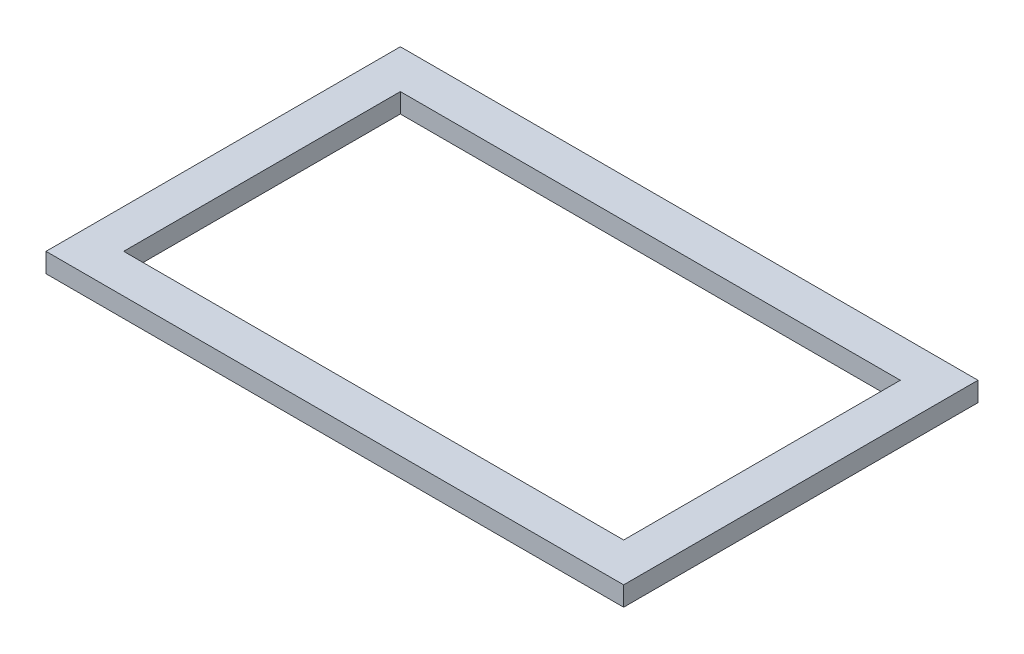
ISO-10303-21;
HEADER;
FILE_DESCRIPTION(('STEP AP214'),'2;1');
FILE_NAME('part.step','',(''),(''),'','','');
FILE_SCHEMA(('AUTOMOTIVE_DESIGN { 1 0 10303 214 1 1 1 1 }'));
ENDSEC;
DATA;
#1=APPLICATION_CONTEXT('core data for automotive mechanical design processes');
#2=APPLICATION_PROTOCOL_DEFINITION('international standard','automotive_design',2000,#1);
#3=PRODUCT_CONTEXT('',#1,'mechanical');
#4=PRODUCT('Part','Part','',(#3));
#5=PRODUCT_RELATED_PRODUCT_CATEGORY('part','',(#4));
#6=PRODUCT_DEFINITION_FORMATION('','',#4);
#7=PRODUCT_DEFINITION_CONTEXT('part definition',#1,'design');
#8=PRODUCT_DEFINITION('design','',#6,#7);
#9=PRODUCT_DEFINITION_SHAPE('','',#8);
#10=(LENGTH_UNIT() NAMED_UNIT(*) SI_UNIT(.MILLI.,.METRE.));
#11=(NAMED_UNIT(*) PLANE_ANGLE_UNIT() SI_UNIT($,.RADIAN.));
#12=(NAMED_UNIT(*) SI_UNIT($,.STERADIAN.) SOLID_ANGLE_UNIT());
#13=UNCERTAINTY_MEASURE_WITH_UNIT(LENGTH_MEASURE(1.E-05),#10,'distance_accuracy_value','');
#14=(GEOMETRIC_REPRESENTATION_CONTEXT(3) GLOBAL_UNCERTAINTY_ASSIGNED_CONTEXT((#13)) GLOBAL_UNIT_ASSIGNED_CONTEXT((#10,
#11,#12)) REPRESENTATION_CONTEXT('',''));
#15=CARTESIAN_POINT('',(0.,0.,0.));
#16=DIRECTION('',(0.,0.,1.));
#17=DIRECTION('',(1.,0.,0.));
#18=AXIS2_PLACEMENT_3D('',#15,#16,#17);
#19=CARTESIAN_POINT('',(59.5,4.,-36.5));
#20=DIRECTION('',(0.,-1.,0.));
#21=DIRECTION('',(0.,0.,-1.));
#22=AXIS2_PLACEMENT_3D('',#19,#20,#21);
#23=PLANE('',#22);
#24=DIRECTION('',(0.,0.,-1.));
#25=VECTOR('',#24,1.);
#26=CARTESIAN_POINT('',(59.5,4.,36.5));
#27=LINE('',#26,#25);
#28=CARTESIAN_POINT('',(59.5,4.,36.5));
#29=VERTEX_POINT('',#28);
#30=CARTESIAN_POINT('',(59.5,4.,-36.5));
#31=VERTEX_POINT('',#30);
#32=EDGE_CURVE('E132',#29,#31,#27,.T.);
#33=ORIENTED_EDGE('',*,*,#32,.T.);
#34=DIRECTION('',(-1.,0.,0.));
#35=VECTOR('',#34,1.);
#36=CARTESIAN_POINT('',(-59.5,4.,-36.5));
#37=LINE('',#36,#35);
#38=CARTESIAN_POINT('',(-59.5,4.,-36.5));
#39=VERTEX_POINT('',#38);
#40=EDGE_CURVE('E135',#31,#39,#37,.T.);
#41=ORIENTED_EDGE('',*,*,#40,.T.);
#42=DIRECTION('',(0.,0.,1.));
#43=VECTOR('',#42,1.);
#44=CARTESIAN_POINT('',(-59.5,4.,36.5));
#45=LINE('',#44,#43);
#46=CARTESIAN_POINT('',(-59.5,4.,36.5));
#47=VERTEX_POINT('',#46);
#48=EDGE_CURVE('E138',#39,#47,#45,.T.);
#49=ORIENTED_EDGE('',*,*,#48,.T.);
#50=DIRECTION('',(1.,0.,0.));
#51=VECTOR('',#50,1.);
#52=CARTESIAN_POINT('',(-59.5,4.,36.5));
#53=LINE('',#52,#51);
#54=EDGE_CURVE('E140',#47,#29,#53,.T.);
#55=ORIENTED_EDGE('',*,*,#54,.T.);
#56=EDGE_LOOP('',(#33,#41,#49,#55));
#57=FACE_BOUND('',#56,.T.);
#58=DIRECTION('',(0.,0.,-1.));
#59=VECTOR('',#58,1.);
#60=CARTESIAN_POINT('',(51.5,4.,28.5));
#61=LINE('',#60,#59);
#62=CARTESIAN_POINT('',(51.5,4.,28.5));
#63=VERTEX_POINT('',#62);
#64=CARTESIAN_POINT('',(51.5,4.,-28.5));
#65=VERTEX_POINT('',#64);
#66=EDGE_CURVE('E96',#63,#65,#61,.T.);
#67=ORIENTED_EDGE('',*,*,#66,.F.);
#68=DIRECTION('',(1.,0.,0.));
#69=VECTOR('',#68,1.);
#70=CARTESIAN_POINT('',(-51.5,4.,28.5));
#71=LINE('',#70,#69);
#72=CARTESIAN_POINT('',(-51.5,4.,28.5));
#73=VERTEX_POINT('',#72);
#74=EDGE_CURVE('E118',#73,#63,#71,.T.);
#75=ORIENTED_EDGE('',*,*,#74,.F.);
#76=DIRECTION('',(0.,0.,1.));
#77=VECTOR('',#76,1.);
#78=CARTESIAN_POINT('',(-51.5,4.,28.5));
#79=LINE('',#78,#77);
#80=CARTESIAN_POINT('',(-51.5,4.,-28.5));
#81=VERTEX_POINT('',#80);
#82=EDGE_CURVE('E116',#81,#73,#79,.T.);
#83=ORIENTED_EDGE('',*,*,#82,.F.);
#84=DIRECTION('',(-1.,0.,0.));
#85=VECTOR('',#84,1.);
#86=CARTESIAN_POINT('',(-51.5,4.,-28.5));
#87=LINE('',#86,#85);
#88=EDGE_CURVE('E104',#65,#81,#87,.T.);
#89=ORIENTED_EDGE('',*,*,#88,.F.);
#90=EDGE_LOOP('',(#67,#75,#83,#89));
#91=FACE_BOUND('',#90,.T.);
#92=ADVANCED_FACE('F31',(#57,#91),#23,.F.);
#93=CARTESIAN_POINT('',(59.5,0.,-36.5));
#94=DIRECTION('',(0.,-1.,0.));
#95=DIRECTION('',(0.,0.,-1.));
#96=AXIS2_PLACEMENT_3D('',#93,#94,#95);
#97=PLANE('',#96);
#98=DIRECTION('',(0.,0.,-1.));
#99=VECTOR('',#98,1.);
#100=CARTESIAN_POINT('',(59.5,0.,36.5));
#101=LINE('',#100,#99);
#102=CARTESIAN_POINT('',(59.5,0.,36.5));
#103=VERTEX_POINT('',#102);
#104=CARTESIAN_POINT('',(59.5,0.,-36.5));
#105=VERTEX_POINT('',#104);
#106=EDGE_CURVE('E112',#103,#105,#101,.T.);
#107=ORIENTED_EDGE('',*,*,#106,.F.);
#108=DIRECTION('',(1.,0.,0.));
#109=VECTOR('',#108,1.);
#110=CARTESIAN_POINT('',(-59.5,0.,36.5));
#111=LINE('',#110,#109);
#112=CARTESIAN_POINT('',(-59.5,0.,36.5));
#113=VERTEX_POINT('',#112);
#114=EDGE_CURVE('E136',#113,#103,#111,.T.);
#115=ORIENTED_EDGE('',*,*,#114,.F.);
#116=DIRECTION('',(0.,0.,1.));
#117=VECTOR('',#116,1.);
#118=CARTESIAN_POINT('',(-59.5,0.,36.5));
#119=LINE('',#118,#117);
#120=CARTESIAN_POINT('',(-59.5,0.,-36.5));
#121=VERTEX_POINT('',#120);
#122=EDGE_CURVE('E147',#121,#113,#119,.T.);
#123=ORIENTED_EDGE('',*,*,#122,.F.);
#124=DIRECTION('',(-1.,0.,0.));
#125=VECTOR('',#124,1.);
#126=CARTESIAN_POINT('',(-59.5,0.,-36.5));
#127=LINE('',#126,#125);
#128=EDGE_CURVE('E145',#105,#121,#127,.T.);
#129=ORIENTED_EDGE('',*,*,#128,.F.);
#130=EDGE_LOOP('',(#107,#115,#123,#129));
#131=FACE_BOUND('',#130,.T.);
#132=DIRECTION('',(1.,0.,0.));
#133=VECTOR('',#132,1.);
#134=CARTESIAN_POINT('',(-51.5,0.,28.5));
#135=LINE('',#134,#133);
#136=CARTESIAN_POINT('',(-51.5,0.,28.5));
#137=VERTEX_POINT('',#136);
#138=CARTESIAN_POINT('',(51.5,0.,28.5));
#139=VERTEX_POINT('',#138);
#140=EDGE_CURVE('E105',#137,#139,#135,.T.);
#141=ORIENTED_EDGE('',*,*,#140,.T.);
#142=DIRECTION('',(0.,0.,-1.));
#143=VECTOR('',#142,1.);
#144=CARTESIAN_POINT('',(51.5,0.,28.5));
#145=LINE('',#144,#143);
#146=CARTESIAN_POINT('',(51.5,0.,-28.5));
#147=VERTEX_POINT('',#146);
#148=EDGE_CURVE('E54',#139,#147,#145,.T.);
#149=ORIENTED_EDGE('',*,*,#148,.T.);
#150=DIRECTION('',(-1.,0.,0.));
#151=VECTOR('',#150,1.);
#152=CARTESIAN_POINT('',(-51.5,0.,-28.5));
#153=LINE('',#152,#151);
#154=CARTESIAN_POINT('',(-51.5,0.,-28.5));
#155=VERTEX_POINT('',#154);
#156=EDGE_CURVE('E111',#147,#155,#153,.T.);
#157=ORIENTED_EDGE('',*,*,#156,.T.);
#158=DIRECTION('',(0.,0.,1.));
#159=VECTOR('',#158,1.);
#160=CARTESIAN_POINT('',(-51.5,0.,28.5));
#161=LINE('',#160,#159);
#162=EDGE_CURVE('E124',#155,#137,#161,.T.);
#163=ORIENTED_EDGE('',*,*,#162,.T.);
#164=EDGE_LOOP('',(#141,#149,#157,#163));
#165=FACE_BOUND('',#164,.T.);
#166=ADVANCED_FACE('F165',(#131,#165),#97,.T.);
#167=CARTESIAN_POINT('',(59.5,4.,36.5));
#168=DIRECTION('',(-1.,0.,0.));
#169=DIRECTION('',(0.,0.,1.));
#170=AXIS2_PLACEMENT_3D('',#167,#168,#169);
#171=PLANE('',#170);
#172=ORIENTED_EDGE('',*,*,#106,.T.);
#173=DIRECTION('',(0.,-1.,0.));
#174=VECTOR('',#173,1.);
#175=CARTESIAN_POINT('',(59.5,4.,-36.5));
#176=LINE('',#175,#174);
#177=EDGE_CURVE('E11',#31,#105,#176,.T.);
#178=ORIENTED_EDGE('',*,*,#177,.F.);
#179=ORIENTED_EDGE('',*,*,#32,.F.);
#180=DIRECTION('',(0.,-1.,0.));
#181=VECTOR('',#180,1.);
#182=CARTESIAN_POINT('',(59.5,4.,36.5));
#183=LINE('',#182,#181);
#184=EDGE_CURVE('E142',#29,#103,#183,.T.);
#185=ORIENTED_EDGE('',*,*,#184,.T.);
#186=EDGE_LOOP('',(#172,#178,#179,#185));
#187=FACE_BOUND('',#186,.T.);
#188=ADVANCED_FACE('F33',(#187),#171,.F.);
#189=CARTESIAN_POINT('',(-59.5,4.,-36.5));
#190=DIRECTION('',(0.,0.,1.));
#191=DIRECTION('',(1.,0.,0.));
#192=AXIS2_PLACEMENT_3D('',#189,#190,#191);
#193=PLANE('',#192);
#194=ORIENTED_EDGE('',*,*,#128,.T.);
#195=DIRECTION('',(0.,-1.,0.));
#196=VECTOR('',#195,1.);
#197=CARTESIAN_POINT('',(-59.5,4.,-36.5));
#198=LINE('',#197,#196);
#199=EDGE_CURVE('E39',#39,#121,#198,.T.);
#200=ORIENTED_EDGE('',*,*,#199,.F.);
#201=ORIENTED_EDGE('',*,*,#40,.F.);
#202=ORIENTED_EDGE('',*,*,#177,.T.);
#203=EDGE_LOOP('',(#194,#200,#201,#202));
#204=FACE_BOUND('',#203,.T.);
#205=ADVANCED_FACE('F175',(#204),#193,.F.);
#206=CARTESIAN_POINT('',(-59.5,4.,36.5));
#207=DIRECTION('',(1.,0.,0.));
#208=DIRECTION('',(0.,0.,-1.));
#209=AXIS2_PLACEMENT_3D('',#206,#207,#208);
#210=PLANE('',#209);
#211=ORIENTED_EDGE('',*,*,#122,.T.);
#212=DIRECTION('',(0.,-1.,0.));
#213=VECTOR('',#212,1.);
#214=CARTESIAN_POINT('',(-59.5,4.,36.5));
#215=LINE('',#214,#213);
#216=EDGE_CURVE('E152',#47,#113,#215,.T.);
#217=ORIENTED_EDGE('',*,*,#216,.F.);
#218=ORIENTED_EDGE('',*,*,#48,.F.);
#219=ORIENTED_EDGE('',*,*,#199,.T.);
#220=EDGE_LOOP('',(#211,#217,#218,#219));
#221=FACE_BOUND('',#220,.T.);
#222=ADVANCED_FACE('F159',(#221),#210,.F.);
#223=CARTESIAN_POINT('',(-59.5,4.,36.5));
#224=DIRECTION('',(0.,0.,-1.));
#225=DIRECTION('',(-1.,0.,0.));
#226=AXIS2_PLACEMENT_3D('',#223,#224,#225);
#227=PLANE('',#226);
#228=ORIENTED_EDGE('',*,*,#114,.T.);
#229=ORIENTED_EDGE('',*,*,#184,.F.);
#230=ORIENTED_EDGE('',*,*,#54,.F.);
#231=ORIENTED_EDGE('',*,*,#216,.T.);
#232=EDGE_LOOP('',(#228,#229,#230,#231));
#233=FACE_BOUND('',#232,.T.);
#234=ADVANCED_FACE('F169',(#233),#227,.F.);
#235=CARTESIAN_POINT('',(51.5,4.,28.5));
#236=DIRECTION('',(-1.,0.,0.));
#237=DIRECTION('',(0.,0.,1.));
#238=AXIS2_PLACEMENT_3D('',#235,#236,#237);
#239=PLANE('',#238);
#240=ORIENTED_EDGE('',*,*,#148,.F.);
#241=DIRECTION('',(0.,-1.,0.));
#242=VECTOR('',#241,1.);
#243=CARTESIAN_POINT('',(51.5,4.,28.5));
#244=LINE('',#243,#242);
#245=EDGE_CURVE('E100',#63,#139,#244,.T.);
#246=ORIENTED_EDGE('',*,*,#245,.F.);
#247=ORIENTED_EDGE('',*,*,#66,.T.);
#248=DIRECTION('',(0.,-1.,0.));
#249=VECTOR('',#248,1.);
#250=CARTESIAN_POINT('',(51.5,4.,-28.5));
#251=LINE('',#250,#249);
#252=EDGE_CURVE('E99',#65,#147,#251,.T.);
#253=ORIENTED_EDGE('',*,*,#252,.T.);
#254=EDGE_LOOP('',(#240,#246,#247,#253));
#255=FACE_BOUND('',#254,.T.);
#256=ADVANCED_FACE('F98',(#255),#239,.T.);
#257=CARTESIAN_POINT('',(-51.5,4.,-28.5));
#258=DIRECTION('',(0.,0.,1.));
#259=DIRECTION('',(1.,0.,0.));
#260=AXIS2_PLACEMENT_3D('',#257,#258,#259);
#261=PLANE('',#260);
#262=ORIENTED_EDGE('',*,*,#156,.F.);
#263=ORIENTED_EDGE('',*,*,#252,.F.);
#264=ORIENTED_EDGE('',*,*,#88,.T.);
#265=DIRECTION('',(0.,-1.,0.));
#266=VECTOR('',#265,1.);
#267=CARTESIAN_POINT('',(-51.5,4.,-28.5));
#268=LINE('',#267,#266);
#269=EDGE_CURVE('E113',#81,#155,#268,.T.);
#270=ORIENTED_EDGE('',*,*,#269,.T.);
#271=EDGE_LOOP('',(#262,#263,#264,#270));
#272=FACE_BOUND('',#271,.T.);
#273=ADVANCED_FACE('F108',(#272),#261,.T.);
#274=CARTESIAN_POINT('',(-51.5,4.,28.5));
#275=DIRECTION('',(1.,0.,0.));
#276=DIRECTION('',(0.,0.,-1.));
#277=AXIS2_PLACEMENT_3D('',#274,#275,#276);
#278=PLANE('',#277);
#279=ORIENTED_EDGE('',*,*,#162,.F.);
#280=ORIENTED_EDGE('',*,*,#269,.F.);
#281=ORIENTED_EDGE('',*,*,#82,.T.);
#282=DIRECTION('',(0.,-1.,0.));
#283=VECTOR('',#282,1.);
#284=CARTESIAN_POINT('',(-51.5,4.,28.5));
#285=LINE('',#284,#283);
#286=EDGE_CURVE('E46',#73,#137,#285,.T.);
#287=ORIENTED_EDGE('',*,*,#286,.T.);
#288=EDGE_LOOP('',(#279,#280,#281,#287));
#289=FACE_BOUND('',#288,.T.);
#290=ADVANCED_FACE('F198',(#289),#278,.T.);
#291=CARTESIAN_POINT('',(-51.5,4.,28.5));
#292=DIRECTION('',(0.,0.,-1.));
#293=DIRECTION('',(-1.,0.,0.));
#294=AXIS2_PLACEMENT_3D('',#291,#292,#293);
#295=PLANE('',#294);
#296=ORIENTED_EDGE('',*,*,#140,.F.);
#297=ORIENTED_EDGE('',*,*,#286,.F.);
#298=ORIENTED_EDGE('',*,*,#74,.T.);
#299=ORIENTED_EDGE('',*,*,#245,.T.);
#300=EDGE_LOOP('',(#296,#297,#298,#299));
#301=FACE_BOUND('',#300,.T.);
#302=ADVANCED_FACE('F202',(#301),#295,.T.);
#303=CLOSED_SHELL('',(#92,#166,#188,#205,#222,#234,#256,#273,#290,#302));
#304=MANIFOLD_SOLID_BREP('B2',#303);
#305=ADVANCED_BREP_SHAPE_REPRESENTATION('',(#18,#304),#14);
#306=SHAPE_DEFINITION_REPRESENTATION(#9,#305);
ENDSEC;
END-ISO-10303-21;
